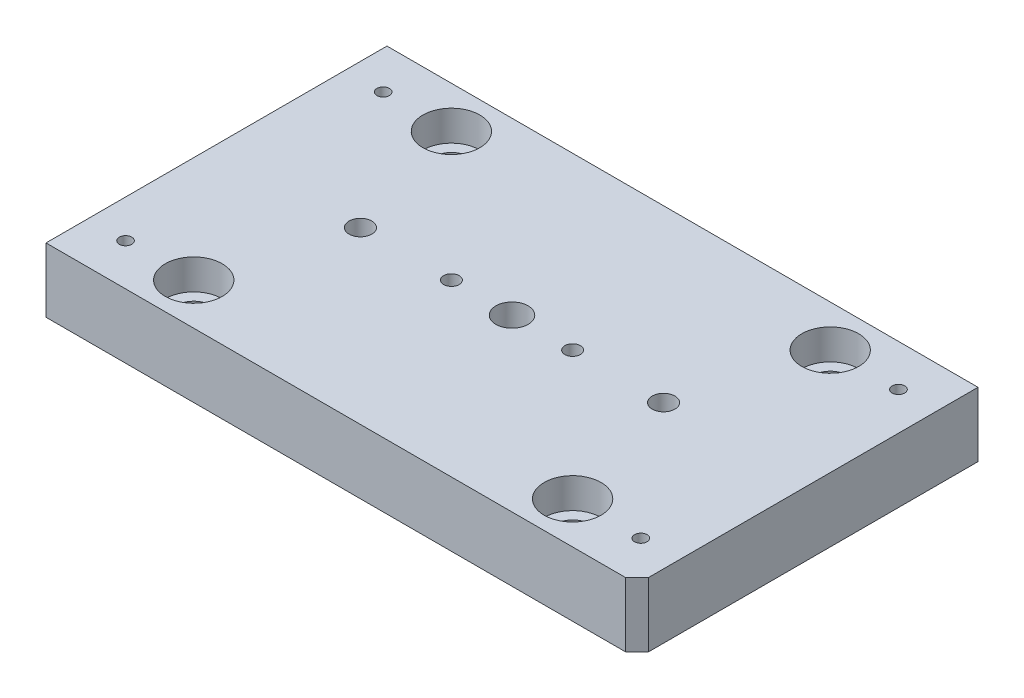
from build123d import *

# Parameters (mm, degrees)
ESQUISSE1_W                                     = 156
ESQUISSE1_H                                     = 90
EXTRUSION1_DEPTH                                = 17
TROU_TARAUD_M4X0_71_D                           = 3.3
TROU_TARAUD_M4X0_71_DEPTH                       = 10.1
TROU_TARAUD_M4X0_71_TIP                         = 0.991420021
CHAMBRAGE_POUR_VIS_T_TE_CYLINDRIQUE_D           = 9
CHAMBRAGE_POUR_VIS_T_TE_CYLINDRIQUE_CBORE_D     = 15
CHAMBRAGE_POUR_VIS_T_TE_CYLINDRIQUE_CBORE_DEPTH = 8
ESQUISSE6_R                                     = 2.05
ENL_V_MAT_EXTRU_1_DEPTH                         = 92.640602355
TROU_TARAUD_M10X1_51_D                          = 8.5
TROU_TARAUD_M10X1_51_ON_FACE_2_D                = 8.5
ESQUISSE8_R                                     = 4.5
ENL_V_MAT_EXTRU_2_DEPTH                         = 8
ESQUISSE9_R                                     = 6.75
ENL_V_MAT_EXTRU_5_DEPTH                         = 4
CHANFREIN_D_SIZE                                = 3
ESQUISSE10_R                                    = 3
ENL_V_MAT_EXTRU_6_DEPTH                         = 92.640602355


with BuildPart() as part:
    # Esquisse1 → Extrusion1 (new body)
    with BuildSketch(Plane(origin=(0, 0, 0), x_dir=(1, 0, 0), z_dir=(0, 1, 0))):
        Rectangle(ESQUISSE1_W, ESQUISSE1_H)
    extrude(amount=EXTRUSION1_DEPTH)

    # Trou taraud_ M4x0.71
    with Locations(Plane(origin=(0, 17, 0), x_dir=(-1, 0, 0), z_dir=(0, 1, 0))):
        with Locations((-68, 34), (-68, -34), (68, -34), (68, 34)):
            Hole(TROU_TARAUD_M4X0_71_D / 2, depth=TROU_TARAUD_M4X0_71_DEPTH)
            with Locations((0, 0, -(TROU_TARAUD_M4X0_71_DEPTH + TROU_TARAUD_M4X0_71_TIP / 2))):  # 118° drill point
                Cone(0, TROU_TARAUD_M4X0_71_D / 2, TROU_TARAUD_M4X0_71_TIP, mode=Mode.SUBTRACT)

    # Chambrage pour vis _ t_te cylindrique (through all)
    with Locations(Plane(origin=(0, 17, 0), x_dir=(-1, 0, 0), z_dir=(0, 1, 0))):
        with Locations((-50, 34), (-50, -34), (50, -34), (50, 34)):
            CounterBoreHole(CHAMBRAGE_POUR_VIS_T_TE_CYLINDRIQUE_D / 2, CHAMBRAGE_POUR_VIS_T_TE_CYLINDRIQUE_CBORE_D / 2, CHAMBRAGE_POUR_VIS_T_TE_CYLINDRIQUE_CBORE_DEPTH)

    # Esquisse6 → Enl_v. mat.-Extru.1 (cut, through all)
    with BuildSketch(Plane(origin=(0, 17, 0), x_dir=(-1, 0, 0), z_dir=(0, 1, 0))):
        with Locations(Location((-16, 0, 0), (0, 0, 90))):
            Circle(ESQUISSE6_R)
        with Locations(Location((16, 0, 0), (0, 0, 90))):
            Circle(ESQUISSE6_R)
    extrude(amount=-ENL_V_MAT_EXTRU_1_DEPTH, mode=Mode.SUBTRACT)

    # Trou taraud_ M10x1.51 (through all)
    with Locations(Plane(origin=(0, 0, 0), x_dir=(0, 0, -1), z_dir=(0, -1, 0))):
        with Locations((0, 0)):
            Hole(TROU_TARAUD_M10X1_51_D / 2)

    # Trou taraud_ M10x1.51 on face 2 (through all)
    with Locations(Plane.ZX.offset(17)):
        with Locations((0, 0)):
            Hole(TROU_TARAUD_M10X1_51_ON_FACE_2_D / 2)

    # Esquisse8 → Enl_v. mat.-Extru.2 (cut)
    with BuildSketch(Plane.XZ):
        with Locations(Location((16, 0, 0), (0, 0, 270))):
            Circle(ESQUISSE8_R)
        with Locations(Location((-16, 0, 0), (0, 0, 270))):
            Circle(ESQUISSE8_R)
    extrude(amount=-ENL_V_MAT_EXTRU_2_DEPTH, mode=Mode.SUBTRACT)

    # Esquisse9 → Enl_v. mat.-Extru.5 (cut)
    with BuildSketch(Plane.XZ):
        with Locations(Location((0, 0, 0), (0, 0, 270))):
            Circle(ESQUISSE9_R)
    extrude(amount=-ENL_V_MAT_EXTRU_5_DEPTH, mode=Mode.SUBTRACT)

    # Chanfrein_D
    chanfrein_d_edges = [part.edges().sort_by_distance(p)[0] for p in [
        (78, 8.5, 45),
    ]]
    chamfer(chanfrein_d_edges, length=CHANFREIN_D_SIZE)

    # Esquisse10 → Enl_v. mat.-Extru.6 (cut, through all)
    with BuildSketch(Plane.XZ):
        with Locations(Location((40, 0, 0), (0, 0, 270))):
            Circle(ESQUISSE10_R)
        with Locations(Location((-40, 0, 0), (0, 0, 270))):
            Circle(ESQUISSE10_R)
    extrude(amount=-ENL_V_MAT_EXTRU_6_DEPTH, mode=Mode.SUBTRACT)


solid = part.part
